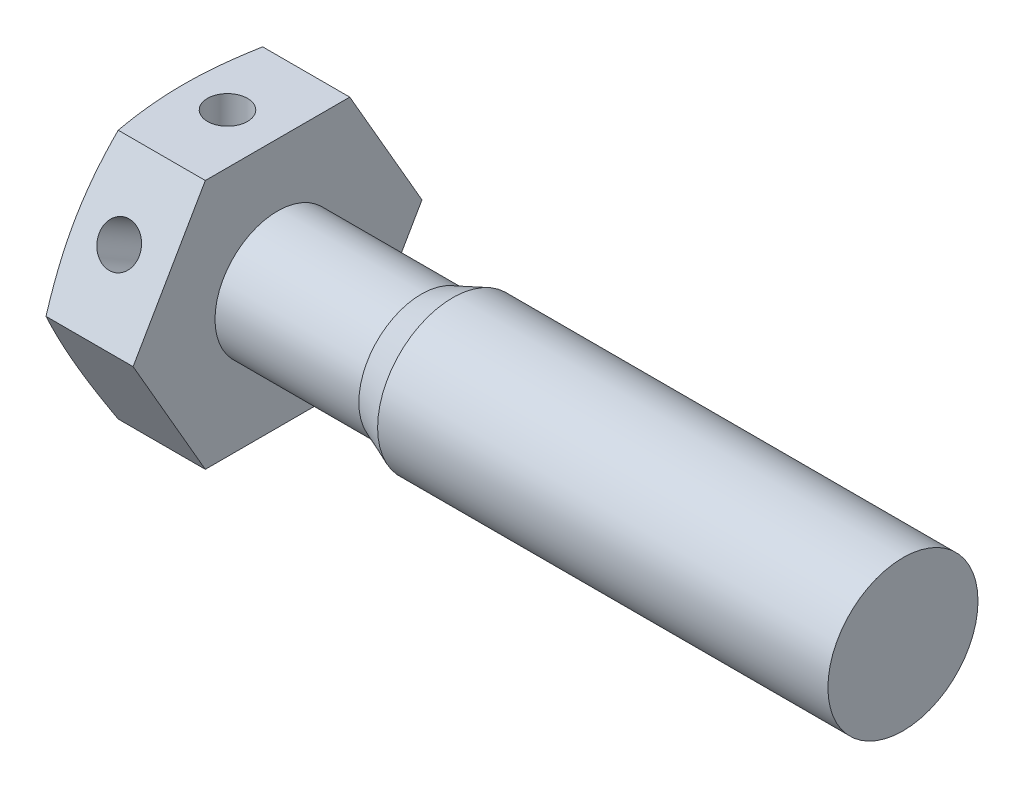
from build123d import *

# Parameters (mm, degrees)
BASEHEAD_DEPTH     = 4
SKETCH2_R          = 3
BASEBODY_DEPTH     = 25
SKETCH4_R          = 3.4
CUT_EXTRUDE1_DEPTH = 0.8
SKETCH6_R          = 0.8
HOLE_DEPTH         = 30.988886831
CIRPATTERN1_COUNT  = 2
CIRPATTERN1_ANGLE  = 60


with BuildPart() as part:
    # Sketch1 → BaseHead (new body)
    with BuildSketch(Plane(origin=(0, 0, 0), x_dir=(0, 0, -1), z_dir=(1, 0, 0))):
        Polygon((5.773502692, 0), (2.886751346, 5), (-2.886751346, 5), (-5.773502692, 0), (-2.886751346, -5), (2.886751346, -5), align=None)
    extrude(amount=BASEHEAD_DEPTH)

    # Sketch2 → BaseBody (add)
    with BuildSketch(Plane(origin=(4, 0, 0), x_dir=(0, 0, -1), z_dir=(1, 0, 0))):
        Circle(SKETCH2_R)
    extrude(amount=BASEBODY_DEPTH)

    # Sketch3 → HeadChamfer (revolve, cut)
    with BuildSketch(Plane(origin=(3.161211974, 0, 2.612290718), x_dir=(0, 0, -1), z_dir=(0, 1, 0)), mode=Mode.PRIVATE) as headchamfer_sk:
        Polygon((8.38579341, 3.161211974), (8.38579341, 2.643099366), (6.962290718, 3.161211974), align=None)
    revolve(headchamfer_sk.sketch.rotate(Axis((-2.071354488, 0, 0), (1, 0, 0)), 180), axis=Axis((-2.071354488, 0, 0), (1, 0, 0)), mode=Mode.SUBTRACT)

    # Sketch4 → Cut-Extrude1 (cut)
    with BuildSketch(Plane.ZY):
        Circle(SKETCH4_R)
    extrude(amount=-CUT_EXTRUDE1_DEPTH, mode=Mode.SUBTRACT)

    # Sketch5 → Cut-Revolve1 (revolve, cut)
    with BuildSketch(Plane(origin=(-2.92963122, 0, 7.92963122), x_dir=(0, 0, -1), z_dir=(0, 1, 0)), mode=Mode.PRIVATE) as cut_revolve1_sk:
        Polygon((10.92963122, -13.92963122), (10.42963122, -12.67963122), (10.42963122, -6.92963122), (12.92963122, -6.92963122), (12.92963122, -13.92963122), align=None)
    revolve(cut_revolve1_sk.sketch.rotate(Axis((-2.697175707, 0, 0), (1, 0, 0)), 180), axis=Axis((-2.697175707, 0, 0), (1, 0, 0)), mode=Mode.SUBTRACT)

    # Sketch6 → Hole (cut, symmetric)
    with BuildSketch(Plane(origin=(0, 0, 0), x_dir=(1, 0, 0), z_dir=(0, 1, 0))):
        with Locations(Location((2, 0, 0), (0, 0, 270))):
            Circle(SKETCH6_R)
    hole = extrude(amount=HOLE_DEPTH, both=True, mode=Mode.SUBTRACT)

    # CirPattern1: Hole ×2 about axis
    cirpattern1_axis = Axis((-2.697175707, 0, 0), (1, 0, 0))
    for i in range(1, CIRPATTERN1_COUNT):
        add(hole.rotate(cirpattern1_axis, i * CIRPATTERN1_ANGLE / (CIRPATTERN1_COUNT - 1)), mode=Mode.SUBTRACT)


solid = part.part
